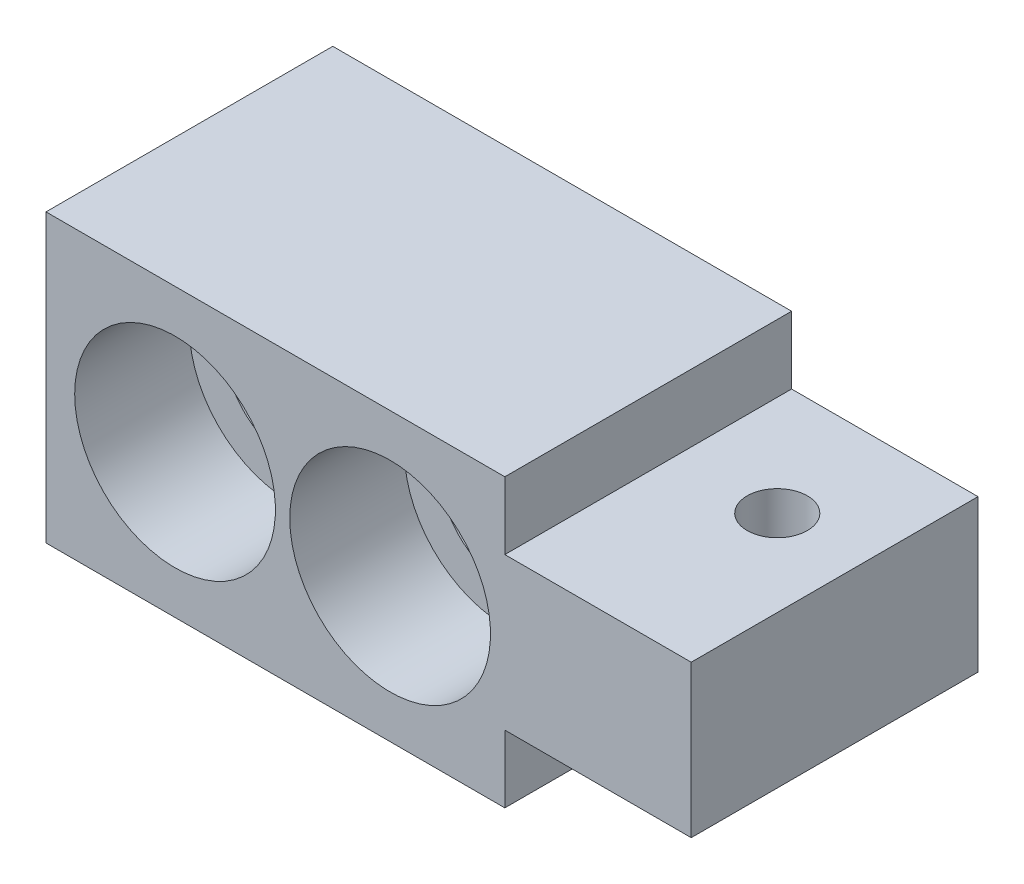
ISO-10303-21;
HEADER;
FILE_DESCRIPTION(('STEP AP214'),'2;1');
FILE_NAME('part.step','',(''),(''),'','','');
FILE_SCHEMA(('AUTOMOTIVE_DESIGN { 1 0 10303 214 1 1 1 1 }'));
ENDSEC;
DATA;
#1=APPLICATION_CONTEXT('core data for automotive mechanical design processes');
#2=APPLICATION_PROTOCOL_DEFINITION('international standard','automotive_design',2000,#1);
#3=PRODUCT_CONTEXT('',#1,'mechanical');
#4=PRODUCT('Part','Part','',(#3));
#5=PRODUCT_RELATED_PRODUCT_CATEGORY('part','',(#4));
#6=PRODUCT_DEFINITION_FORMATION('','',#4);
#7=PRODUCT_DEFINITION_CONTEXT('part definition',#1,'design');
#8=PRODUCT_DEFINITION('design','',#6,#7);
#9=PRODUCT_DEFINITION_SHAPE('','',#8);
#10=(LENGTH_UNIT() NAMED_UNIT(*) SI_UNIT(.MILLI.,.METRE.));
#11=(NAMED_UNIT(*) PLANE_ANGLE_UNIT() SI_UNIT($,.RADIAN.));
#12=(NAMED_UNIT(*) SI_UNIT($,.STERADIAN.) SOLID_ANGLE_UNIT());
#13=UNCERTAINTY_MEASURE_WITH_UNIT(LENGTH_MEASURE(1.E-05),#10,'distance_accuracy_value','');
#14=(GEOMETRIC_REPRESENTATION_CONTEXT(3) GLOBAL_UNCERTAINTY_ASSIGNED_CONTEXT((#13)) GLOBAL_UNIT_ASSIGNED_CONTEXT((#10,
#11,#12)) REPRESENTATION_CONTEXT('',''));
#15=CARTESIAN_POINT('',(0.,0.,0.));
#16=DIRECTION('',(0.,0.,1.));
#17=DIRECTION('',(1.,0.,0.));
#18=AXIS2_PLACEMENT_3D('',#15,#16,#17);
#19=CARTESIAN_POINT('',(36.,10.,20.));
#20=DIRECTION('',(0.,0.,-1.));
#21=DIRECTION('',(0.,-1.,0.));
#22=AXIS2_PLACEMENT_3D('',#19,#20,#21);
#23=PLANE('',#22);
#24=CARTESIAN_POINT('',(0.,0.,20.));
#25=DIRECTION('',(0.,0.,1.));
#26=DIRECTION('',(-1.,0.,0.));
#27=AXIS2_PLACEMENT_3D('',#24,#25,#26);
#28=CIRCLE('',#27,7.);
#29=CARTESIAN_POINT('',(-7.,0.,20.));
#30=VERTEX_POINT('',#29);
#31=EDGE_CURVE('E157',#30,#30,#28,.T.);
#32=ORIENTED_EDGE('',*,*,#31,.F.);
#33=EDGE_LOOP('',(#32));
#34=FACE_BOUND('',#33,.T.);
#35=DIRECTION('',(0.,1.,0.));
#36=VECTOR('',#35,1.);
#37=CARTESIAN_POINT('',(23.,5.3,20.));
#38=LINE('',#37,#36);
#39=CARTESIAN_POINT('',(23.,5.3,20.));
#40=VERTEX_POINT('',#39);
#41=CARTESIAN_POINT('',(23.,10.,20.));
#42=VERTEX_POINT('',#41);
#43=EDGE_CURVE('E88',#40,#42,#38,.T.);
#44=ORIENTED_EDGE('',*,*,#43,.T.);
#45=DIRECTION('',(-1.,0.,0.));
#46=VECTOR('',#45,1.);
#47=CARTESIAN_POINT('',(36.,10.,20.));
#48=LINE('',#47,#46);
#49=CARTESIAN_POINT('',(-9.,10.,20.));
#50=VERTEX_POINT('',#49);
#51=EDGE_CURVE('E22',#42,#50,#48,.T.);
#52=ORIENTED_EDGE('',*,*,#51,.T.);
#53=DIRECTION('',(0.,-1.,0.));
#54=VECTOR('',#53,1.);
#55=CARTESIAN_POINT('',(-9.,10.,20.));
#56=LINE('',#55,#54);
#57=CARTESIAN_POINT('',(-9.,-10.,20.));
#58=VERTEX_POINT('',#57);
#59=EDGE_CURVE('E129',#50,#58,#56,.T.);
#60=ORIENTED_EDGE('',*,*,#59,.T.);
#61=DIRECTION('',(-1.,0.,0.));
#62=VECTOR('',#61,1.);
#63=CARTESIAN_POINT('',(36.,-10.,20.));
#64=LINE('',#63,#62);
#65=CARTESIAN_POINT('',(23.,-10.,20.));
#66=VERTEX_POINT('',#65);
#67=EDGE_CURVE('E140',#66,#58,#64,.T.);
#68=ORIENTED_EDGE('',*,*,#67,.F.);
#69=DIRECTION('',(0.,-1.,0.));
#70=VECTOR('',#69,1.);
#71=CARTESIAN_POINT('',(23.,-5.3,20.));
#72=LINE('',#71,#70);
#73=CARTESIAN_POINT('',(23.,-5.3,20.));
#74=VERTEX_POINT('',#73);
#75=EDGE_CURVE('E108',#74,#66,#72,.T.);
#76=ORIENTED_EDGE('',*,*,#75,.F.);
#77=DIRECTION('',(1.,0.,0.));
#78=VECTOR('',#77,1.);
#79=CARTESIAN_POINT('',(23.,-5.3,20.));
#80=LINE('',#79,#78);
#81=CARTESIAN_POINT('',(36.,-5.3,20.));
#82=VERTEX_POINT('',#81);
#83=EDGE_CURVE('E110',#74,#82,#80,.T.);
#84=ORIENTED_EDGE('',*,*,#83,.T.);
#85=DIRECTION('',(0.,-1.,0.));
#86=VECTOR('',#85,1.);
#87=CARTESIAN_POINT('',(36.,10.,20.));
#88=LINE('',#87,#86);
#89=CARTESIAN_POINT('',(36.,5.3,20.));
#90=VERTEX_POINT('',#89);
#91=EDGE_CURVE('E99',#90,#82,#88,.T.);
#92=ORIENTED_EDGE('',*,*,#91,.F.);
#93=DIRECTION('',(1.,0.,0.));
#94=VECTOR('',#93,1.);
#95=CARTESIAN_POINT('',(23.,5.3,20.));
#96=LINE('',#95,#94);
#97=EDGE_CURVE('E82',#40,#90,#96,.T.);
#98=ORIENTED_EDGE('',*,*,#97,.F.);
#99=EDGE_LOOP('',(#44,#52,#60,#68,#76,#84,#92,#98));
#100=FACE_BOUND('',#99,.T.);
#101=CARTESIAN_POINT('',(15.,0.,20.));
#102=DIRECTION('',(0.,0.,1.));
#103=DIRECTION('',(-1.,0.,0.));
#104=AXIS2_PLACEMENT_3D('',#101,#102,#103);
#105=CIRCLE('',#104,7.);
#106=CARTESIAN_POINT('',(8.,0.,20.));
#107=VERTEX_POINT('',#106);
#108=EDGE_CURVE('E168',#107,#107,#105,.T.);
#109=ORIENTED_EDGE('',*,*,#108,.F.);
#110=EDGE_LOOP('',(#109));
#111=FACE_BOUND('',#110,.T.);
#112=ADVANCED_FACE('F14',(#34,#100,#111),#23,.F.);
#113=CARTESIAN_POINT('',(36.,-10.,0.));
#114=DIRECTION('',(0.,0.,1.));
#115=DIRECTION('',(0.,1.,0.));
#116=AXIS2_PLACEMENT_3D('',#113,#114,#115);
#117=PLANE('',#116);
#118=CARTESIAN_POINT('',(0.,0.,0.));
#119=DIRECTION('',(0.,0.,1.));
#120=DIRECTION('',(0.,1.,0.));
#121=AXIS2_PLACEMENT_3D('',#118,#119,#120);
#122=CIRCLE('',#121,4.5);
#123=CARTESIAN_POINT('',(0.,4.5,0.));
#124=VERTEX_POINT('',#123);
#125=EDGE_CURVE('E145',#124,#124,#122,.F.);
#126=ORIENTED_EDGE('',*,*,#125,.F.);
#127=EDGE_LOOP('',(#126));
#128=FACE_BOUND('',#127,.T.);
#129=DIRECTION('',(0.,1.,0.));
#130=VECTOR('',#129,1.);
#131=CARTESIAN_POINT('',(23.,5.3,0.));
#132=LINE('',#131,#130);
#133=CARTESIAN_POINT('',(23.,5.3,0.));
#134=VERTEX_POINT('',#133);
#135=CARTESIAN_POINT('',(23.,10.,0.));
#136=VERTEX_POINT('',#135);
#137=EDGE_CURVE('E100',#134,#136,#132,.T.);
#138=ORIENTED_EDGE('',*,*,#137,.F.);
#139=DIRECTION('',(1.,0.,0.));
#140=VECTOR('',#139,1.);
#141=CARTESIAN_POINT('',(23.,5.3,0.));
#142=LINE('',#141,#140);
#143=CARTESIAN_POINT('',(36.,5.3,0.));
#144=VERTEX_POINT('',#143);
#145=EDGE_CURVE('E83',#134,#144,#142,.T.);
#146=ORIENTED_EDGE('',*,*,#145,.T.);
#147=DIRECTION('',(0.,1.,0.));
#148=VECTOR('',#147,1.);
#149=CARTESIAN_POINT('',(36.,-10.,0.));
#150=LINE('',#149,#148);
#151=CARTESIAN_POINT('',(36.,-5.3,0.));
#152=VERTEX_POINT('',#151);
#153=EDGE_CURVE('E132',#152,#144,#150,.T.);
#154=ORIENTED_EDGE('',*,*,#153,.F.);
#155=DIRECTION('',(1.,0.,0.));
#156=VECTOR('',#155,1.);
#157=CARTESIAN_POINT('',(23.,-5.3,0.));
#158=LINE('',#157,#156);
#159=CARTESIAN_POINT('',(23.,-5.3,0.));
#160=VERTEX_POINT('',#159);
#161=EDGE_CURVE('E37',#160,#152,#158,.T.);
#162=ORIENTED_EDGE('',*,*,#161,.F.);
#163=DIRECTION('',(0.,-1.,0.));
#164=VECTOR('',#163,1.);
#165=CARTESIAN_POINT('',(23.,-5.3,0.));
#166=LINE('',#165,#164);
#167=CARTESIAN_POINT('',(23.,-10.,0.));
#168=VERTEX_POINT('',#167);
#169=EDGE_CURVE('E112',#160,#168,#166,.T.);
#170=ORIENTED_EDGE('',*,*,#169,.T.);
#171=DIRECTION('',(-1.,0.,0.));
#172=VECTOR('',#171,1.);
#173=CARTESIAN_POINT('',(36.,-10.,0.));
#174=LINE('',#173,#172);
#175=CARTESIAN_POINT('',(-9.,-10.,0.));
#176=VERTEX_POINT('',#175);
#177=EDGE_CURVE('E138',#168,#176,#174,.T.);
#178=ORIENTED_EDGE('',*,*,#177,.T.);
#179=DIRECTION('',(0.,1.,0.));
#180=VECTOR('',#179,1.);
#181=CARTESIAN_POINT('',(-9.,-10.,0.));
#182=LINE('',#181,#180);
#183=CARTESIAN_POINT('',(-9.,10.,0.));
#184=VERTEX_POINT('',#183);
#185=EDGE_CURVE('E123',#176,#184,#182,.T.);
#186=ORIENTED_EDGE('',*,*,#185,.T.);
#187=DIRECTION('',(-1.,0.,0.));
#188=VECTOR('',#187,1.);
#189=CARTESIAN_POINT('',(36.,10.,0.));
#190=LINE('',#189,#188);
#191=EDGE_CURVE('E136',#136,#184,#190,.T.);
#192=ORIENTED_EDGE('',*,*,#191,.F.);
#193=EDGE_LOOP('',(#138,#146,#154,#162,#170,#178,#186,#192));
#194=FACE_BOUND('',#193,.T.);
#195=CARTESIAN_POINT('',(15.,0.,0.));
#196=DIRECTION('',(0.,0.,1.));
#197=DIRECTION('',(0.,1.,0.));
#198=AXIS2_PLACEMENT_3D('',#195,#196,#197);
#199=CIRCLE('',#198,4.5);
#200=CARTESIAN_POINT('',(15.,4.5,0.));
#201=VERTEX_POINT('',#200);
#202=EDGE_CURVE('E17',#201,#201,#199,.F.);
#203=ORIENTED_EDGE('',*,*,#202,.F.);
#204=EDGE_LOOP('',(#203));
#205=FACE_BOUND('',#204,.T.);
#206=ADVANCED_FACE('F175',(#128,#194,#205),#117,.F.);
#207=CARTESIAN_POINT('',(36.,10.,20.));
#208=DIRECTION('',(0.,1.,0.));
#209=DIRECTION('',(0.,0.,-1.));
#210=AXIS2_PLACEMENT_3D('',#207,#208,#209);
#211=PLANE('',#210);
#212=ORIENTED_EDGE('',*,*,#51,.F.);
#213=DIRECTION('',(0.,0.,-1.));
#214=VECTOR('',#213,1.);
#215=CARTESIAN_POINT('',(23.,10.,20.));
#216=LINE('',#215,#214);
#217=EDGE_CURVE('E91',#42,#136,#216,.T.);
#218=ORIENTED_EDGE('',*,*,#217,.T.);
#219=ORIENTED_EDGE('',*,*,#191,.T.);
#220=DIRECTION('',(0.,0.,-1.));
#221=VECTOR('',#220,1.);
#222=CARTESIAN_POINT('',(-9.,10.,20.));
#223=LINE('',#222,#221);
#224=EDGE_CURVE('E120',#50,#184,#223,.T.);
#225=ORIENTED_EDGE('',*,*,#224,.F.);
#226=EDGE_LOOP('',(#212,#218,#219,#225));
#227=FACE_BOUND('',#226,.T.);
#228=ADVANCED_FACE('F182',(#227),#211,.T.);
#229=CARTESIAN_POINT('',(36.,10.,20.));
#230=DIRECTION('',(-1.,0.,0.));
#231=DIRECTION('',(0.,-1.,0.));
#232=AXIS2_PLACEMENT_3D('',#229,#230,#231);
#233=PLANE('',#232);
#234=ORIENTED_EDGE('',*,*,#153,.T.);
#235=DIRECTION('',(0.,0.,1.));
#236=VECTOR('',#235,1.);
#237=CARTESIAN_POINT('',(36.,5.3,20.));
#238=LINE('',#237,#236);
#239=EDGE_CURVE('E30',#144,#90,#238,.T.);
#240=ORIENTED_EDGE('',*,*,#239,.T.);
#241=ORIENTED_EDGE('',*,*,#91,.T.);
#242=DIRECTION('',(0.,0.,1.));
#243=VECTOR('',#242,1.);
#244=CARTESIAN_POINT('',(36.,-5.3,20.));
#245=LINE('',#244,#243);
#246=EDGE_CURVE('E9',#152,#82,#245,.T.);
#247=ORIENTED_EDGE('',*,*,#246,.F.);
#248=EDGE_LOOP('',(#234,#240,#241,#247));
#249=FACE_BOUND('',#248,.T.);
#250=ADVANCED_FACE('F228',(#249),#233,.F.);
#251=CARTESIAN_POINT('',(36.,-10.,0.));
#252=DIRECTION('',(0.,-1.,0.));
#253=DIRECTION('',(1.,0.,0.));
#254=AXIS2_PLACEMENT_3D('',#251,#252,#253);
#255=PLANE('',#254);
#256=DIRECTION('',(0.,0.,-1.));
#257=VECTOR('',#256,1.);
#258=CARTESIAN_POINT('',(23.,-10.,0.));
#259=LINE('',#258,#257);
#260=EDGE_CURVE('E118',#66,#168,#259,.T.);
#261=ORIENTED_EDGE('',*,*,#260,.F.);
#262=ORIENTED_EDGE('',*,*,#67,.T.);
#263=DIRECTION('',(0.,0.,1.));
#264=VECTOR('',#263,1.);
#265=CARTESIAN_POINT('',(-9.,-10.,0.));
#266=LINE('',#265,#264);
#267=EDGE_CURVE('E126',#176,#58,#266,.T.);
#268=ORIENTED_EDGE('',*,*,#267,.F.);
#269=ORIENTED_EDGE('',*,*,#177,.F.);
#270=EDGE_LOOP('',(#261,#262,#268,#269));
#271=FACE_BOUND('',#270,.T.);
#272=ADVANCED_FACE('F226',(#271),#255,.T.);
#273=CARTESIAN_POINT('',(-9.,10.,20.));
#274=DIRECTION('',(-1.,0.,0.));
#275=DIRECTION('',(0.,-1.,0.));
#276=AXIS2_PLACEMENT_3D('',#273,#274,#275);
#277=PLANE('',#276);
#278=ORIENTED_EDGE('',*,*,#224,.T.);
#279=ORIENTED_EDGE('',*,*,#185,.F.);
#280=ORIENTED_EDGE('',*,*,#267,.T.);
#281=ORIENTED_EDGE('',*,*,#59,.F.);
#282=EDGE_LOOP('',(#278,#279,#280,#281));
#283=FACE_BOUND('',#282,.T.);
#284=ADVANCED_FACE('F219',(#283),#277,.T.);
#285=CARTESIAN_POINT('',(23.,-5.3,0.));
#286=DIRECTION('',(0.,-1.,0.));
#287=DIRECTION('',(1.,0.,0.));
#288=AXIS2_PLACEMENT_3D('',#285,#286,#287);
#289=PLANE('',#288);
#290=CARTESIAN_POINT('',(30.,-5.3,8.));
#291=DIRECTION('',(0.,-1.,0.));
#292=DIRECTION('',(1.,0.,0.));
#293=AXIS2_PLACEMENT_3D('',#290,#291,#292);
#294=CIRCLE('',#293,2.1);
#295=CARTESIAN_POINT('',(32.1,-5.3,8.));
#296=VERTEX_POINT('',#295);
#297=EDGE_CURVE('E144',#296,#296,#294,.T.);
#298=ORIENTED_EDGE('',*,*,#297,.F.);
#299=EDGE_LOOP('',(#298));
#300=FACE_BOUND('',#299,.T.);
#301=ORIENTED_EDGE('',*,*,#246,.T.);
#302=ORIENTED_EDGE('',*,*,#83,.F.);
#303=DIRECTION('',(0.,0.,1.));
#304=VECTOR('',#303,1.);
#305=CARTESIAN_POINT('',(23.,-5.3,0.));
#306=LINE('',#305,#304);
#307=EDGE_CURVE('E116',#160,#74,#306,.T.);
#308=ORIENTED_EDGE('',*,*,#307,.F.);
#309=ORIENTED_EDGE('',*,*,#161,.T.);
#310=EDGE_LOOP('',(#301,#302,#308,#309));
#311=FACE_BOUND('',#310,.T.);
#312=ADVANCED_FACE('F216',(#300,#311),#289,.T.);
#313=CARTESIAN_POINT('',(23.,-5.3,0.));
#314=DIRECTION('',(-1.,0.,0.));
#315=DIRECTION('',(0.,-1.,0.));
#316=AXIS2_PLACEMENT_3D('',#313,#314,#315);
#317=PLANE('',#316);
#318=ORIENTED_EDGE('',*,*,#260,.T.);
#319=ORIENTED_EDGE('',*,*,#169,.F.);
#320=ORIENTED_EDGE('',*,*,#307,.T.);
#321=ORIENTED_EDGE('',*,*,#75,.T.);
#322=EDGE_LOOP('',(#318,#319,#320,#321));
#323=FACE_BOUND('',#322,.T.);
#324=ADVANCED_FACE('F214',(#323),#317,.F.);
#325=CARTESIAN_POINT('',(23.,5.3,0.));
#326=DIRECTION('',(0.,-1.,0.));
#327=DIRECTION('',(0.,0.,1.));
#328=AXIS2_PLACEMENT_3D('',#325,#326,#327);
#329=PLANE('',#328);
#330=CARTESIAN_POINT('',(30.,5.3,8.));
#331=DIRECTION('',(0.,-1.,0.));
#332=DIRECTION('',(0.,0.,1.));
#333=AXIS2_PLACEMENT_3D('',#330,#331,#332);
#334=CIRCLE('',#333,2.1);
#335=CARTESIAN_POINT('',(30.,5.3,10.1));
#336=VERTEX_POINT('',#335);
#337=EDGE_CURVE('E94',#336,#336,#334,.T.);
#338=ORIENTED_EDGE('',*,*,#337,.T.);
#339=EDGE_LOOP('',(#338));
#340=FACE_BOUND('',#339,.T.);
#341=ORIENTED_EDGE('',*,*,#145,.F.);
#342=DIRECTION('',(0.,0.,1.));
#343=VECTOR('',#342,1.);
#344=CARTESIAN_POINT('',(23.,5.3,0.));
#345=LINE('',#344,#343);
#346=EDGE_CURVE('E78',#134,#40,#345,.T.);
#347=ORIENTED_EDGE('',*,*,#346,.T.);
#348=ORIENTED_EDGE('',*,*,#97,.T.);
#349=ORIENTED_EDGE('',*,*,#239,.F.);
#350=EDGE_LOOP('',(#341,#347,#348,#349));
#351=FACE_BOUND('',#350,.T.);
#352=ADVANCED_FACE('F80',(#340,#351),#329,.F.);
#353=CARTESIAN_POINT('',(23.,5.3,0.));
#354=DIRECTION('',(1.,0.,0.));
#355=DIRECTION('',(0.,1.,0.));
#356=AXIS2_PLACEMENT_3D('',#353,#354,#355);
#357=PLANE('',#356);
#358=ORIENTED_EDGE('',*,*,#43,.F.);
#359=ORIENTED_EDGE('',*,*,#346,.F.);
#360=ORIENTED_EDGE('',*,*,#137,.T.);
#361=ORIENTED_EDGE('',*,*,#217,.F.);
#362=EDGE_LOOP('',(#358,#359,#360,#361));
#363=FACE_BOUND('',#362,.T.);
#364=ADVANCED_FACE('F89',(#363),#357,.T.);
#365=CARTESIAN_POINT('',(30.,10.,8.));
#366=DIRECTION('',(0.,-1.,0.));
#367=DIRECTION('',(1.,0.,0.));
#368=AXIS2_PLACEMENT_3D('',#365,#366,#367);
#369=CYLINDRICAL_SURFACE('',#368,2.1);
#370=ORIENTED_EDGE('',*,*,#297,.T.);
#371=EDGE_LOOP('',(#370));
#372=FACE_BOUND('',#371,.T.);
#373=ORIENTED_EDGE('',*,*,#337,.F.);
#374=EDGE_LOOP('',(#373));
#375=FACE_BOUND('',#374,.T.);
#376=ADVANCED_FACE('F203',(#372,#375),#369,.F.);
#377=CARTESIAN_POINT('',(0.,0.,20.));
#378=DIRECTION('',(0.,0.,1.));
#379=DIRECTION('',(-1.,0.,0.));
#380=AXIS2_PLACEMENT_3D('',#377,#378,#379);
#381=CYLINDRICAL_SURFACE('',#380,4.5);
#382=CARTESIAN_POINT('',(0.,0.,12.));
#383=DIRECTION('',(0.,0.,1.));
#384=DIRECTION('',(-1.,0.,0.));
#385=AXIS2_PLACEMENT_3D('',#382,#383,#384);
#386=CIRCLE('',#385,4.5);
#387=CARTESIAN_POINT('',(-4.5,0.,12.));
#388=VERTEX_POINT('',#387);
#389=EDGE_CURVE('E147',#388,#388,#386,.T.);
#390=ORIENTED_EDGE('',*,*,#389,.T.);
#391=EDGE_LOOP('',(#390));
#392=FACE_BOUND('',#391,.T.);
#393=ORIENTED_EDGE('',*,*,#125,.T.);
#394=EDGE_LOOP('',(#393));
#395=FACE_BOUND('',#394,.T.);
#396=ADVANCED_FACE('F197',(#392,#395),#381,.F.);
#397=CARTESIAN_POINT('',(0.,-4.5,12.));
#398=DIRECTION('',(0.,0.,1.));
#399=DIRECTION('',(-1.,0.,0.));
#400=AXIS2_PLACEMENT_3D('',#397,#398,#399);
#401=PLANE('',#400);
#402=CARTESIAN_POINT('',(0.,0.,12.));
#403=DIRECTION('',(0.,0.,1.));
#404=DIRECTION('',(-1.,0.,0.));
#405=AXIS2_PLACEMENT_3D('',#402,#403,#404);
#406=CIRCLE('',#405,7.);
#407=CARTESIAN_POINT('',(-7.,0.,12.));
#408=VERTEX_POINT('',#407);
#409=EDGE_CURVE('E152',#408,#408,#406,.T.);
#410=ORIENTED_EDGE('',*,*,#409,.T.);
#411=EDGE_LOOP('',(#410));
#412=FACE_BOUND('',#411,.T.);
#413=ORIENTED_EDGE('',*,*,#389,.F.);
#414=EDGE_LOOP('',(#413));
#415=FACE_BOUND('',#414,.T.);
#416=ADVANCED_FACE('F191',(#412,#415),#401,.T.);
#417=CARTESIAN_POINT('',(0.,0.,20.));
#418=DIRECTION('',(0.,0.,1.));
#419=DIRECTION('',(-1.,0.,0.));
#420=AXIS2_PLACEMENT_3D('',#417,#418,#419);
#421=CYLINDRICAL_SURFACE('',#420,7.);
#422=ORIENTED_EDGE('',*,*,#31,.T.);
#423=EDGE_LOOP('',(#422));
#424=FACE_BOUND('',#423,.T.);
#425=ORIENTED_EDGE('',*,*,#409,.F.);
#426=EDGE_LOOP('',(#425));
#427=FACE_BOUND('',#426,.T.);
#428=ADVANCED_FACE('F187',(#424,#427),#421,.F.);
#429=CARTESIAN_POINT('',(15.,0.,20.));
#430=DIRECTION('',(0.,0.,1.));
#431=DIRECTION('',(-1.,0.,0.));
#432=AXIS2_PLACEMENT_3D('',#429,#430,#431);
#433=CYLINDRICAL_SURFACE('',#432,4.5);
#434=CARTESIAN_POINT('',(15.,0.,12.));
#435=DIRECTION('',(0.,0.,1.));
#436=DIRECTION('',(-1.,0.,0.));
#437=AXIS2_PLACEMENT_3D('',#434,#435,#436);
#438=CIRCLE('',#437,4.5);
#439=CARTESIAN_POINT('',(10.5,0.,12.));
#440=VERTEX_POINT('',#439);
#441=EDGE_CURVE('E162',#440,#440,#438,.T.);
#442=ORIENTED_EDGE('',*,*,#441,.T.);
#443=EDGE_LOOP('',(#442));
#444=FACE_BOUND('',#443,.T.);
#445=ORIENTED_EDGE('',*,*,#202,.T.);
#446=EDGE_LOOP('',(#445));
#447=FACE_BOUND('',#446,.T.);
#448=ADVANCED_FACE('F190',(#444,#447),#433,.F.);
#449=CARTESIAN_POINT('',(15.,-4.5,12.));
#450=DIRECTION('',(0.,0.,1.));
#451=DIRECTION('',(-1.,0.,0.));
#452=AXIS2_PLACEMENT_3D('',#449,#450,#451);
#453=PLANE('',#452);
#454=CARTESIAN_POINT('',(15.,0.,12.));
#455=DIRECTION('',(0.,0.,1.));
#456=DIRECTION('',(-1.,0.,0.));
#457=AXIS2_PLACEMENT_3D('',#454,#455,#456);
#458=CIRCLE('',#457,7.);
#459=CARTESIAN_POINT('',(8.,0.,12.));
#460=VERTEX_POINT('',#459);
#461=EDGE_CURVE('E165',#460,#460,#458,.T.);
#462=ORIENTED_EDGE('',*,*,#461,.T.);
#463=EDGE_LOOP('',(#462));
#464=FACE_BOUND('',#463,.T.);
#465=ORIENTED_EDGE('',*,*,#441,.F.);
#466=EDGE_LOOP('',(#465));
#467=FACE_BOUND('',#466,.T.);
#468=ADVANCED_FACE('F257',(#464,#467),#453,.T.);
#469=CARTESIAN_POINT('',(15.,0.,20.));
#470=DIRECTION('',(0.,0.,1.));
#471=DIRECTION('',(-1.,0.,0.));
#472=AXIS2_PLACEMENT_3D('',#469,#470,#471);
#473=CYLINDRICAL_SURFACE('',#472,7.);
#474=ORIENTED_EDGE('',*,*,#108,.T.);
#475=EDGE_LOOP('',(#474));
#476=FACE_BOUND('',#475,.T.);
#477=ORIENTED_EDGE('',*,*,#461,.F.);
#478=EDGE_LOOP('',(#477));
#479=FACE_BOUND('',#478,.T.);
#480=ADVANCED_FACE('F172',(#476,#479),#473,.F.);
#481=CLOSED_SHELL('',(#112,#206,#228,#250,#272,#284,#312,#324,#352,#364,#376,#396,#416,#428,
#448,#468,#480));
#482=MANIFOLD_SOLID_BREP('B1',#481);
#483=ADVANCED_BREP_SHAPE_REPRESENTATION('',(#18,#482),#14);
#484=SHAPE_DEFINITION_REPRESENTATION(#9,#483);
ENDSEC;
END-ISO-10303-21;
